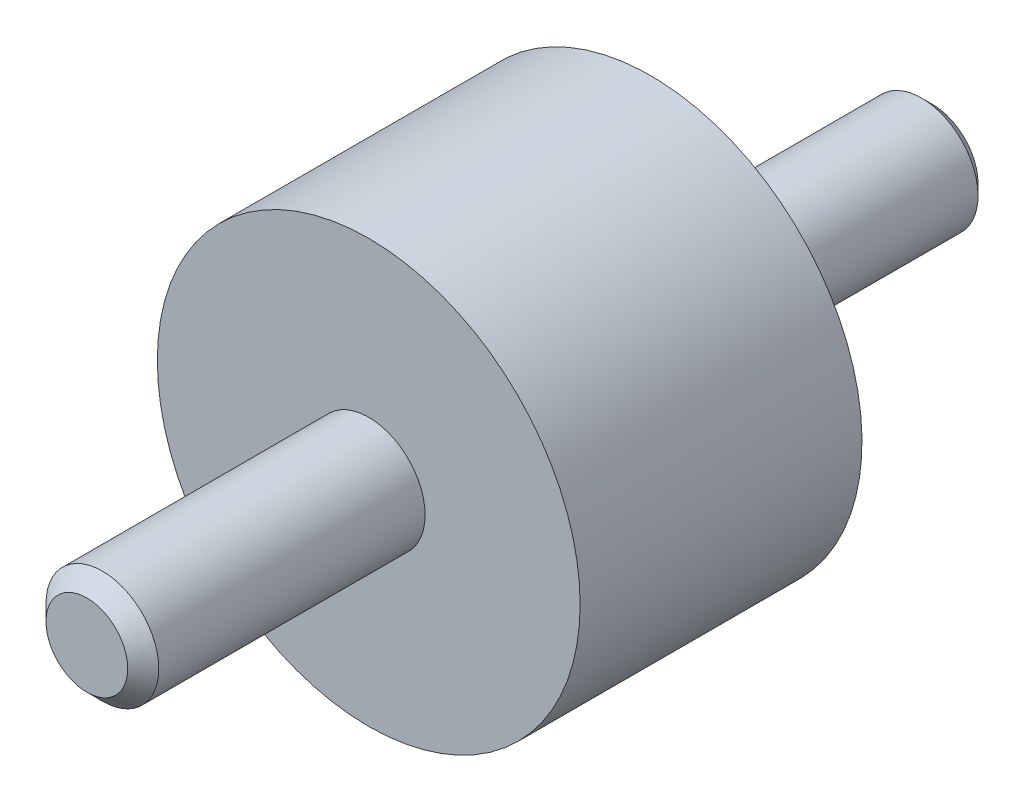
ISO-10303-21;
HEADER;
FILE_DESCRIPTION(('STEP AP214'),'2;1');
FILE_NAME('part.step','',(''),(''),'','','');
FILE_SCHEMA(('AUTOMOTIVE_DESIGN { 1 0 10303 214 1 1 1 1 }'));
ENDSEC;
DATA;
#1=APPLICATION_CONTEXT('core data for automotive mechanical design processes');
#2=APPLICATION_PROTOCOL_DEFINITION('international standard','automotive_design',2000,#1);
#3=PRODUCT_CONTEXT('',#1,'mechanical');
#4=PRODUCT('Part','Part','',(#3));
#5=PRODUCT_RELATED_PRODUCT_CATEGORY('part','',(#4));
#6=PRODUCT_DEFINITION_FORMATION('','',#4);
#7=PRODUCT_DEFINITION_CONTEXT('part definition',#1,'design');
#8=PRODUCT_DEFINITION('design','',#6,#7);
#9=PRODUCT_DEFINITION_SHAPE('','',#8);
#10=(LENGTH_UNIT() NAMED_UNIT(*) SI_UNIT(.MILLI.,.METRE.));
#11=(NAMED_UNIT(*) PLANE_ANGLE_UNIT() SI_UNIT($,.RADIAN.));
#12=(NAMED_UNIT(*) SI_UNIT($,.STERADIAN.) SOLID_ANGLE_UNIT());
#13=UNCERTAINTY_MEASURE_WITH_UNIT(LENGTH_MEASURE(1.E-05),#10,'distance_accuracy_value','');
#14=(GEOMETRIC_REPRESENTATION_CONTEXT(3) GLOBAL_UNCERTAINTY_ASSIGNED_CONTEXT((#13)) GLOBAL_UNIT_ASSIGNED_CONTEXT((#10,
#11,#12)) REPRESENTATION_CONTEXT('',''));
#15=CARTESIAN_POINT('',(0.,0.,0.));
#16=DIRECTION('',(0.,0.,1.));
#17=DIRECTION('',(1.,0.,0.));
#18=AXIS2_PLACEMENT_3D('',#15,#16,#17);
#19=CARTESIAN_POINT('',(0.,0.,0.5));
#20=DIRECTION('',(0.,0.,1.));
#21=DIRECTION('',(0.,-1.,0.));
#22=AXIS2_PLACEMENT_3D('',#19,#20,#21);
#23=CYLINDRICAL_SURFACE('',#22,15.);
#24=CARTESIAN_POINT('',(0.,0.,0.));
#25=DIRECTION('',(0.,0.,1.));
#26=DIRECTION('',(0.,-1.,0.));
#27=AXIS2_PLACEMENT_3D('',#24,#25,#26);
#28=CIRCLE('',#27,15.);
#29=CARTESIAN_POINT('',(0.,-15.,0.));
#30=VERTEX_POINT('',#29);
#31=EDGE_CURVE('E22',#30,#30,#28,.T.);
#32=ORIENTED_EDGE('',*,*,#31,.T.);
#33=EDGE_LOOP('',(#32));
#34=FACE_BOUND('',#33,.T.);
#35=CARTESIAN_POINT('',(0.,0.,20.));
#36=DIRECTION('',(0.,0.,-1.));
#37=DIRECTION('',(-1.,0.,0.));
#38=AXIS2_PLACEMENT_3D('',#35,#36,#37);
#39=CIRCLE('',#38,15.);
#40=CARTESIAN_POINT('',(-15.,0.,20.));
#41=VERTEX_POINT('',#40);
#42=EDGE_CURVE('E34',#41,#41,#39,.T.);
#43=ORIENTED_EDGE('',*,*,#42,.T.);
#44=EDGE_LOOP('',(#43));
#45=FACE_BOUND('',#44,.T.);
#46=ADVANCED_FACE('F12',(#34,#45),#23,.T.);
#47=CARTESIAN_POINT('',(15.,0.,0.));
#48=DIRECTION('',(0.,0.,-1.));
#49=DIRECTION('',(0.,1.,0.));
#50=AXIS2_PLACEMENT_3D('',#47,#48,#49);
#51=PLANE('',#50);
#52=CARTESIAN_POINT('',(0.,0.,0.));
#53=DIRECTION('',(0.,0.,-1.));
#54=DIRECTION('',(0.,1.,0.));
#55=AXIS2_PLACEMENT_3D('',#52,#53,#54);
#56=CIRCLE('',#55,4.);
#57=CARTESIAN_POINT('',(0.,4.,0.));
#58=VERTEX_POINT('',#57);
#59=EDGE_CURVE('E18',#58,#58,#56,.T.);
#60=ORIENTED_EDGE('',*,*,#59,.F.);
#61=EDGE_LOOP('',(#60));
#62=FACE_BOUND('',#61,.T.);
#63=ORIENTED_EDGE('',*,*,#31,.F.);
#64=EDGE_LOOP('',(#63));
#65=FACE_BOUND('',#64,.T.);
#66=ADVANCED_FACE('F57',(#62,#65),#51,.T.);
#67=CARTESIAN_POINT('',(0.,0.,-20.));
#68=DIRECTION('',(0.,0.,1.));
#69=DIRECTION('',(0.,-1.,0.));
#70=AXIS2_PLACEMENT_3D('',#67,#68,#69);
#71=CYLINDRICAL_SURFACE('',#70,4.);
#72=CARTESIAN_POINT('',(0.,0.,-19.233));
#73=DIRECTION('',(0.,0.,1.));
#74=DIRECTION('',(0.,-1.,0.));
#75=AXIS2_PLACEMENT_3D('',#72,#73,#74);
#76=CIRCLE('',#75,4.);
#77=CARTESIAN_POINT('',(0.,-4.,-19.233));
#78=VERTEX_POINT('',#77);
#79=EDGE_CURVE('E26',#78,#78,#76,.T.);
#80=ORIENTED_EDGE('',*,*,#79,.T.);
#81=EDGE_LOOP('',(#80));
#82=FACE_BOUND('',#81,.T.);
#83=ORIENTED_EDGE('',*,*,#59,.T.);
#84=EDGE_LOOP('',(#83));
#85=FACE_BOUND('',#84,.T.);
#86=ADVANCED_FACE('F62',(#82,#85),#71,.T.);
#87=CARTESIAN_POINT('',(0.,0.,-19.233));
#88=DIRECTION('',(0.,0.,1.));
#89=DIRECTION('',(0.,-1.,0.));
#90=AXIS2_PLACEMENT_3D('',#87,#88,#89);
#91=CONICAL_SURFACE('',#90,4.,0.785398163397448);
#92=CARTESIAN_POINT('',(0.,0.,-20.));
#93=DIRECTION('',(0.,0.,1.));
#94=DIRECTION('',(0.,-1.,0.));
#95=AXIS2_PLACEMENT_3D('',#92,#93,#94);
#96=CIRCLE('',#95,3.233);
#97=CARTESIAN_POINT('',(0.,-3.233,-20.));
#98=VERTEX_POINT('',#97);
#99=EDGE_CURVE('E31',#98,#98,#96,.T.);
#100=ORIENTED_EDGE('',*,*,#99,.T.);
#101=EDGE_LOOP('',(#100));
#102=FACE_BOUND('',#101,.T.);
#103=ORIENTED_EDGE('',*,*,#79,.F.);
#104=EDGE_LOOP('',(#103));
#105=FACE_BOUND('',#104,.T.);
#106=ADVANCED_FACE('F78',(#102,#105),#91,.T.);
#107=CARTESIAN_POINT('',(3.233,0.,-20.));
#108=DIRECTION('',(0.,0.,-1.));
#109=DIRECTION('',(0.,1.,0.));
#110=AXIS2_PLACEMENT_3D('',#107,#108,#109);
#111=PLANE('',#110);
#112=ORIENTED_EDGE('',*,*,#99,.F.);
#113=EDGE_LOOP('',(#112));
#114=FACE_BOUND('',#113,.T.);
#115=ADVANCED_FACE('F70',(#114),#111,.T.);
#116=CARTESIAN_POINT('',(0.,15.,20.));
#117=DIRECTION('',(0.,0.,1.));
#118=DIRECTION('',(1.,0.,0.));
#119=AXIS2_PLACEMENT_3D('',#116,#117,#118);
#120=PLANE('',#119);
#121=CARTESIAN_POINT('',(0.,0.,20.));
#122=DIRECTION('',(0.,0.,1.));
#123=DIRECTION('',(1.,0.,0.));
#124=AXIS2_PLACEMENT_3D('',#121,#122,#123);
#125=CIRCLE('',#124,4.);
#126=CARTESIAN_POINT('',(4.,0.,20.));
#127=VERTEX_POINT('',#126);
#128=EDGE_CURVE('E8',#127,#127,#125,.F.);
#129=ORIENTED_EDGE('',*,*,#128,.T.);
#130=EDGE_LOOP('',(#129));
#131=FACE_BOUND('',#130,.T.);
#132=ORIENTED_EDGE('',*,*,#42,.F.);
#133=EDGE_LOOP('',(#132));
#134=FACE_BOUND('',#133,.T.);
#135=ADVANCED_FACE('F68',(#131,#134),#120,.T.);
#136=CARTESIAN_POINT('',(0.,0.,15.));
#137=DIRECTION('',(0.,0.,1.));
#138=DIRECTION('',(0.,-1.,0.));
#139=AXIS2_PLACEMENT_3D('',#136,#137,#138);
#140=CYLINDRICAL_SURFACE('',#139,4.);
#141=ORIENTED_EDGE('',*,*,#128,.F.);
#142=EDGE_LOOP('',(#141));
#143=FACE_BOUND('',#142,.T.);
#144=CARTESIAN_POINT('',(0.,0.,38.8999528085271));
#145=DIRECTION('',(0.,0.,-1.));
#146=DIRECTION('',(-1.,0.,0.));
#147=AXIS2_PLACEMENT_3D('',#144,#145,#146);
#148=CIRCLE('',#147,4.);
#149=CARTESIAN_POINT('',(-4.,0.,38.8999528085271));
#150=VERTEX_POINT('',#149);
#151=EDGE_CURVE('E37',#150,#150,#148,.T.);
#152=ORIENTED_EDGE('',*,*,#151,.T.);
#153=EDGE_LOOP('',(#152));
#154=FACE_BOUND('',#153,.T.);
#155=ADVANCED_FACE('F54',(#143,#154),#140,.T.);
#156=CARTESIAN_POINT('',(0.,0.,38.8999528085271));
#157=DIRECTION('',(0.,0.,-1.));
#158=DIRECTION('',(-1.,0.,0.));
#159=AXIS2_PLACEMENT_3D('',#156,#157,#158);
#160=CONICAL_SURFACE('',#159,4.,0.785398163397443);
#161=CARTESIAN_POINT('',(0.,0.,40.));
#162=DIRECTION('',(0.,0.,-1.));
#163=DIRECTION('',(-1.,0.,0.));
#164=AXIS2_PLACEMENT_3D('',#161,#162,#163);
#165=CIRCLE('',#164,2.89995280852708);
#166=CARTESIAN_POINT('',(-2.89995280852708,0.,40.));
#167=VERTEX_POINT('',#166);
#168=EDGE_CURVE('E40',#167,#167,#165,.T.);
#169=ORIENTED_EDGE('',*,*,#168,.T.);
#170=EDGE_LOOP('',(#169));
#171=FACE_BOUND('',#170,.T.);
#172=ORIENTED_EDGE('',*,*,#151,.F.);
#173=EDGE_LOOP('',(#172));
#174=FACE_BOUND('',#173,.T.);
#175=ADVANCED_FACE('F44',(#171,#174),#160,.T.);
#176=CARTESIAN_POINT('',(0.,2.89995280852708,40.));
#177=DIRECTION('',(0.,0.,1.));
#178=DIRECTION('',(1.,0.,0.));
#179=AXIS2_PLACEMENT_3D('',#176,#177,#178);
#180=PLANE('',#179);
#181=ORIENTED_EDGE('',*,*,#168,.F.);
#182=EDGE_LOOP('',(#181));
#183=FACE_BOUND('',#182,.T.);
#184=ADVANCED_FACE('F47',(#183),#180,.T.);
#185=CLOSED_SHELL('',(#46,#66,#86,#106,#115,#135,#155,#175,#184));
#186=MANIFOLD_SOLID_BREP('B1',#185);
#187=ADVANCED_BREP_SHAPE_REPRESENTATION('',(#18,#186),#14);
#188=SHAPE_DEFINITION_REPRESENTATION(#9,#187);
ENDSEC;
END-ISO-10303-21;
